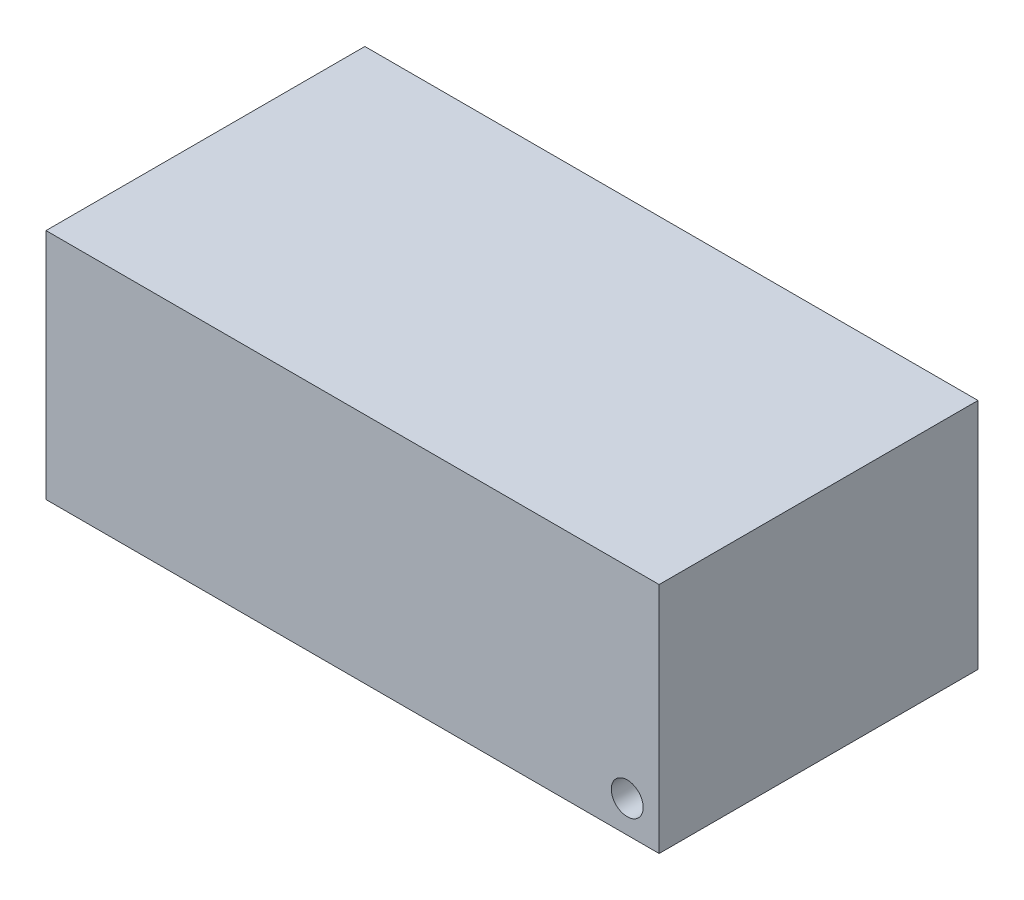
ISO-10303-21;
HEADER;
FILE_DESCRIPTION(('STEP AP214'),'2;1');
FILE_NAME('part.step','',(''),(''),'','','');
FILE_SCHEMA(('AUTOMOTIVE_DESIGN { 1 0 10303 214 1 1 1 1 }'));
ENDSEC;
DATA;
#1=APPLICATION_CONTEXT('core data for automotive mechanical design processes');
#2=APPLICATION_PROTOCOL_DEFINITION('international standard','automotive_design',2000,#1);
#3=PRODUCT_CONTEXT('',#1,'mechanical');
#4=PRODUCT('Part','Part','',(#3));
#5=PRODUCT_RELATED_PRODUCT_CATEGORY('part','',(#4));
#6=PRODUCT_DEFINITION_FORMATION('','',#4);
#7=PRODUCT_DEFINITION_CONTEXT('part definition',#1,'design');
#8=PRODUCT_DEFINITION('design','',#6,#7);
#9=PRODUCT_DEFINITION_SHAPE('','',#8);
#10=(LENGTH_UNIT() NAMED_UNIT(*) SI_UNIT(.MILLI.,.METRE.));
#11=(NAMED_UNIT(*) PLANE_ANGLE_UNIT() SI_UNIT($,.RADIAN.));
#12=(NAMED_UNIT(*) SI_UNIT($,.STERADIAN.) SOLID_ANGLE_UNIT());
#13=UNCERTAINTY_MEASURE_WITH_UNIT(LENGTH_MEASURE(1.E-05),#10,'distance_accuracy_value','');
#14=(GEOMETRIC_REPRESENTATION_CONTEXT(3) GLOBAL_UNCERTAINTY_ASSIGNED_CONTEXT((#13)) GLOBAL_UNIT_ASSIGNED_CONTEXT((#10,
#11,#12)) REPRESENTATION_CONTEXT('',''));
#15=CARTESIAN_POINT('',(0.,0.,0.));
#16=DIRECTION('',(0.,0.,1.));
#17=DIRECTION('',(1.,0.,0.));
#18=AXIS2_PLACEMENT_3D('',#15,#16,#17);
#19=CARTESIAN_POINT('',(48.0713731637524,-18.2642676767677,50.));
#20=DIRECTION('',(-1.,0.,0.));
#21=DIRECTION('',(0.,0.,1.));
#22=AXIS2_PLACEMENT_3D('',#19,#20,#21);
#23=PLANE('',#22);
#24=DIRECTION('',(0.,1.,0.));
#25=VECTOR('',#24,1.);
#26=CARTESIAN_POINT('',(48.0713731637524,-18.2642676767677,0.));
#27=LINE('',#26,#25);
#28=CARTESIAN_POINT('',(48.0713731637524,-18.2642676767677,0.));
#29=VERTEX_POINT('',#28);
#30=CARTESIAN_POINT('',(48.0713731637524,18.2642676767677,0.));
#31=VERTEX_POINT('',#30);
#32=EDGE_CURVE('E95',#29,#31,#27,.T.);
#33=ORIENTED_EDGE('',*,*,#32,.T.);
#34=DIRECTION('',(0.,0.,-1.));
#35=VECTOR('',#34,1.);
#36=CARTESIAN_POINT('',(48.0713731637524,18.2642676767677,50.));
#37=LINE('',#36,#35);
#38=CARTESIAN_POINT('',(48.0713731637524,18.2642676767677,50.));
#39=VERTEX_POINT('',#38);
#40=EDGE_CURVE('E11',#39,#31,#37,.T.);
#41=ORIENTED_EDGE('',*,*,#40,.F.);
#42=DIRECTION('',(0.,1.,0.));
#43=VECTOR('',#42,1.);
#44=CARTESIAN_POINT('',(48.0713731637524,-18.2642676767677,50.));
#45=LINE('',#44,#43);
#46=CARTESIAN_POINT('',(48.0713731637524,-18.2642676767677,50.));
#47=VERTEX_POINT('',#46);
#48=EDGE_CURVE('E83',#47,#39,#45,.T.);
#49=ORIENTED_EDGE('',*,*,#48,.F.);
#50=DIRECTION('',(0.,0.,-1.));
#51=VECTOR('',#50,1.);
#52=CARTESIAN_POINT('',(48.0713731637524,-18.2642676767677,50.));
#53=LINE('',#52,#51);
#54=EDGE_CURVE('E91',#47,#29,#53,.T.);
#55=ORIENTED_EDGE('',*,*,#54,.T.);
#56=EDGE_LOOP('',(#33,#41,#49,#55));
#57=FACE_BOUND('',#56,.T.);
#58=ADVANCED_FACE('F32',(#57),#23,.F.);
#59=CARTESIAN_POINT('',(-48.0713731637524,18.2642676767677,50.));
#60=DIRECTION('',(0.,-1.,0.));
#61=DIRECTION('',(0.,0.,-1.));
#62=AXIS2_PLACEMENT_3D('',#59,#60,#61);
#63=PLANE('',#62);
#64=DIRECTION('',(-1.,0.,0.));
#65=VECTOR('',#64,1.);
#66=CARTESIAN_POINT('',(-48.0713731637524,18.2642676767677,0.));
#67=LINE('',#66,#65);
#68=CARTESIAN_POINT('',(-48.0713731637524,18.2642676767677,0.));
#69=VERTEX_POINT('',#68);
#70=EDGE_CURVE('E87',#31,#69,#67,.T.);
#71=ORIENTED_EDGE('',*,*,#70,.T.);
#72=DIRECTION('',(0.,0.,-1.));
#73=VECTOR('',#72,1.);
#74=CARTESIAN_POINT('',(-48.0713731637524,18.2642676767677,50.));
#75=LINE('',#74,#73);
#76=CARTESIAN_POINT('',(-48.0713731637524,18.2642676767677,50.));
#77=VERTEX_POINT('',#76);
#78=EDGE_CURVE('E40',#77,#69,#75,.T.);
#79=ORIENTED_EDGE('',*,*,#78,.F.);
#80=DIRECTION('',(-1.,0.,0.));
#81=VECTOR('',#80,1.);
#82=CARTESIAN_POINT('',(-48.0713731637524,18.2642676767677,50.));
#83=LINE('',#82,#81);
#84=EDGE_CURVE('E78',#39,#77,#83,.T.);
#85=ORIENTED_EDGE('',*,*,#84,.F.);
#86=ORIENTED_EDGE('',*,*,#40,.T.);
#87=EDGE_LOOP('',(#71,#79,#85,#86));
#88=FACE_BOUND('',#87,.T.);
#89=ADVANCED_FACE('F86',(#88),#63,.F.);
#90=CARTESIAN_POINT('',(-48.0713731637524,-18.2642676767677,50.));
#91=DIRECTION('',(1.,0.,0.));
#92=DIRECTION('',(0.,0.,-1.));
#93=AXIS2_PLACEMENT_3D('',#90,#91,#92);
#94=PLANE('',#93);
#95=DIRECTION('',(0.,-1.,0.));
#96=VECTOR('',#95,1.);
#97=CARTESIAN_POINT('',(-48.0713731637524,-18.2642676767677,0.));
#98=LINE('',#97,#96);
#99=CARTESIAN_POINT('',(-48.0713731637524,-18.2642676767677,0.));
#100=VERTEX_POINT('',#99);
#101=EDGE_CURVE('E65',#69,#100,#98,.T.);
#102=ORIENTED_EDGE('',*,*,#101,.T.);
#103=DIRECTION('',(0.,0.,-1.));
#104=VECTOR('',#103,1.);
#105=CARTESIAN_POINT('',(-48.0713731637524,-18.2642676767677,50.));
#106=LINE('',#105,#104);
#107=CARTESIAN_POINT('',(-48.0713731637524,-18.2642676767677,50.));
#108=VERTEX_POINT('',#107);
#109=EDGE_CURVE('E88',#108,#100,#106,.T.);
#110=ORIENTED_EDGE('',*,*,#109,.F.);
#111=DIRECTION('',(0.,-1.,0.));
#112=VECTOR('',#111,1.);
#113=CARTESIAN_POINT('',(-48.0713731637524,-18.2642676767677,50.));
#114=LINE('',#113,#112);
#115=EDGE_CURVE('E81',#77,#108,#114,.T.);
#116=ORIENTED_EDGE('',*,*,#115,.F.);
#117=ORIENTED_EDGE('',*,*,#78,.T.);
#118=EDGE_LOOP('',(#102,#110,#116,#117));
#119=FACE_BOUND('',#118,.T.);
#120=ADVANCED_FACE('F89',(#119),#94,.F.);
#121=CARTESIAN_POINT('',(-48.0713731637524,-18.2642676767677,50.));
#122=DIRECTION('',(0.,1.,0.));
#123=DIRECTION('',(0.,0.,1.));
#124=AXIS2_PLACEMENT_3D('',#121,#122,#123);
#125=PLANE('',#124);
#126=DIRECTION('',(1.,0.,0.));
#127=VECTOR('',#126,1.);
#128=CARTESIAN_POINT('',(-48.0713731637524,-18.2642676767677,0.));
#129=LINE('',#128,#127);
#130=EDGE_CURVE('E71',#100,#29,#129,.T.);
#131=ORIENTED_EDGE('',*,*,#130,.T.);
#132=ORIENTED_EDGE('',*,*,#54,.F.);
#133=DIRECTION('',(1.,0.,0.));
#134=VECTOR('',#133,1.);
#135=CARTESIAN_POINT('',(-48.0713731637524,-18.2642676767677,50.));
#136=LINE('',#135,#134);
#137=EDGE_CURVE('E48',#108,#47,#136,.T.);
#138=ORIENTED_EDGE('',*,*,#137,.F.);
#139=ORIENTED_EDGE('',*,*,#109,.T.);
#140=EDGE_LOOP('',(#131,#132,#138,#139));
#141=FACE_BOUND('',#140,.T.);
#142=ADVANCED_FACE('F103',(#141),#125,.F.);
#143=CARTESIAN_POINT('',(48.0713731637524,18.2642676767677,50.));
#144=DIRECTION('',(0.,0.,-1.));
#145=DIRECTION('',(-1.,0.,0.));
#146=AXIS2_PLACEMENT_3D('',#143,#144,#145);
#147=PLANE('',#146);
#148=CARTESIAN_POINT('',(43.0713731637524,-13.2642676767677,50.));
#149=DIRECTION('',(0.,0.,1.));
#150=DIRECTION('',(1.,0.,0.));
#151=AXIS2_PLACEMENT_3D('',#148,#149,#150);
#152=CIRCLE('',#151,2.5);
#153=CARTESIAN_POINT('',(45.5713731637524,-13.2642676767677,50.));
#154=VERTEX_POINT('',#153);
#155=EDGE_CURVE('E109',#154,#154,#152,.T.);
#156=ORIENTED_EDGE('',*,*,#155,.F.);
#157=EDGE_LOOP('',(#156));
#158=FACE_BOUND('',#157,.T.);
#159=ORIENTED_EDGE('',*,*,#48,.T.);
#160=ORIENTED_EDGE('',*,*,#84,.T.);
#161=ORIENTED_EDGE('',*,*,#115,.T.);
#162=ORIENTED_EDGE('',*,*,#137,.T.);
#163=EDGE_LOOP('',(#159,#160,#161,#162));
#164=FACE_BOUND('',#163,.T.);
#165=ADVANCED_FACE('F79',(#158,#164),#147,.F.);
#166=CARTESIAN_POINT('',(48.0713731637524,18.2642676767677,0.));
#167=DIRECTION('',(0.,0.,-1.));
#168=DIRECTION('',(-1.,0.,0.));
#169=AXIS2_PLACEMENT_3D('',#166,#167,#168);
#170=PLANE('',#169);
#171=CARTESIAN_POINT('',(43.0713731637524,-13.2642676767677,0.));
#172=DIRECTION('',(0.,0.,1.));
#173=DIRECTION('',(1.,0.,0.));
#174=AXIS2_PLACEMENT_3D('',#171,#172,#173);
#175=CIRCLE('',#174,2.5);
#176=CARTESIAN_POINT('',(45.5713731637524,-13.2642676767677,0.));
#177=VERTEX_POINT('',#176);
#178=EDGE_CURVE('E98',#177,#177,#175,.T.);
#179=ORIENTED_EDGE('',*,*,#178,.T.);
#180=EDGE_LOOP('',(#179));
#181=FACE_BOUND('',#180,.T.);
#182=ORIENTED_EDGE('',*,*,#32,.F.);
#183=ORIENTED_EDGE('',*,*,#130,.F.);
#184=ORIENTED_EDGE('',*,*,#101,.F.);
#185=ORIENTED_EDGE('',*,*,#70,.F.);
#186=EDGE_LOOP('',(#182,#183,#184,#185));
#187=FACE_BOUND('',#186,.T.);
#188=ADVANCED_FACE('F106',(#181,#187),#170,.T.);
#189=CARTESIAN_POINT('',(43.0713731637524,-13.2642676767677,0.));
#190=DIRECTION('',(0.,0.,1.));
#191=DIRECTION('',(1.,0.,0.));
#192=AXIS2_PLACEMENT_3D('',#189,#190,#191);
#193=CYLINDRICAL_SURFACE('',#192,2.5);
#194=ORIENTED_EDGE('',*,*,#178,.F.);
#195=EDGE_LOOP('',(#194));
#196=FACE_BOUND('',#195,.T.);
#197=ORIENTED_EDGE('',*,*,#155,.T.);
#198=EDGE_LOOP('',(#197));
#199=FACE_BOUND('',#198,.T.);
#200=ADVANCED_FACE('F116',(#196,#199),#193,.F.);
#201=CLOSED_SHELL('',(#58,#89,#120,#142,#165,#188,#200));
#202=MANIFOLD_SOLID_BREP('B2',#201);
#203=ADVANCED_BREP_SHAPE_REPRESENTATION('',(#18,#202),#14);
#204=SHAPE_DEFINITION_REPRESENTATION(#9,#203);
ENDSEC;
END-ISO-10303-21;
